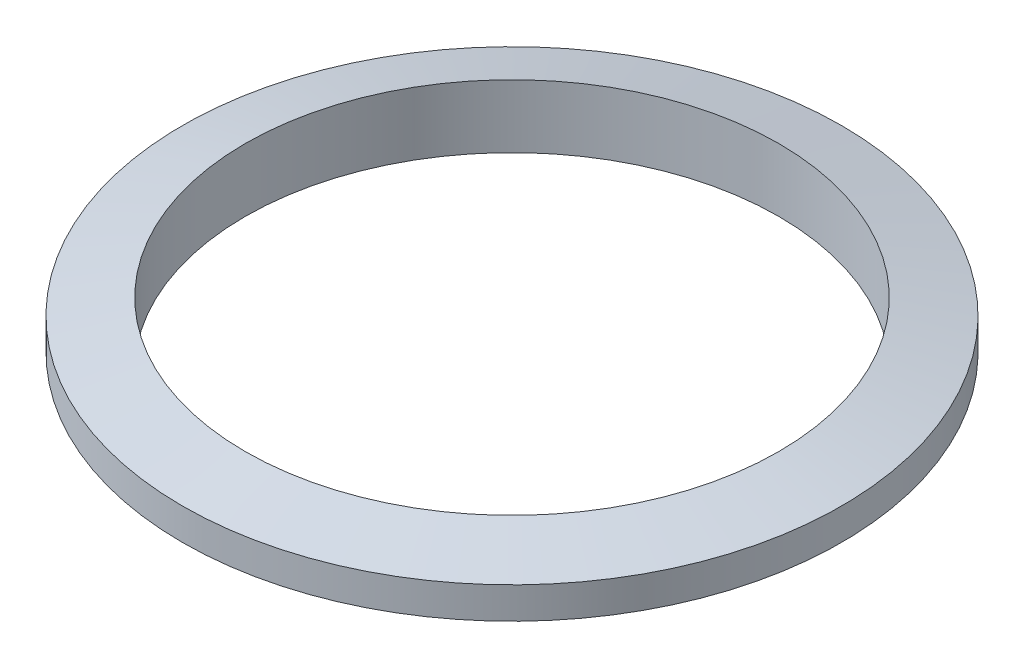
ISO-10303-21;
HEADER;
FILE_DESCRIPTION(('STEP AP214'),'2;1');
FILE_NAME('part.step','',(''),(''),'','','');
FILE_SCHEMA(('AUTOMOTIVE_DESIGN { 1 0 10303 214 1 1 1 1 }'));
ENDSEC;
DATA;
#1=APPLICATION_CONTEXT('core data for automotive mechanical design processes');
#2=APPLICATION_PROTOCOL_DEFINITION('international standard','automotive_design',2000,#1);
#3=PRODUCT_CONTEXT('',#1,'mechanical');
#4=PRODUCT('Part','Part','',(#3));
#5=PRODUCT_RELATED_PRODUCT_CATEGORY('part','',(#4));
#6=PRODUCT_DEFINITION_FORMATION('','',#4);
#7=PRODUCT_DEFINITION_CONTEXT('part definition',#1,'design');
#8=PRODUCT_DEFINITION('design','',#6,#7);
#9=PRODUCT_DEFINITION_SHAPE('','',#8);
#10=(LENGTH_UNIT() NAMED_UNIT(*) SI_UNIT(.MILLI.,.METRE.));
#11=(NAMED_UNIT(*) PLANE_ANGLE_UNIT() SI_UNIT($,.RADIAN.));
#12=(NAMED_UNIT(*) SI_UNIT($,.STERADIAN.) SOLID_ANGLE_UNIT());
#13=UNCERTAINTY_MEASURE_WITH_UNIT(LENGTH_MEASURE(1.E-05),#10,'distance_accuracy_value','');
#14=(GEOMETRIC_REPRESENTATION_CONTEXT(3) GLOBAL_UNCERTAINTY_ASSIGNED_CONTEXT((#13)) GLOBAL_UNIT_ASSIGNED_CONTEXT((#10,
#11,#12)) REPRESENTATION_CONTEXT('',''));
#15=CARTESIAN_POINT('',(0.,0.,0.));
#16=DIRECTION('',(0.,0.,1.));
#17=DIRECTION('',(1.,0.,0.));
#18=AXIS2_PLACEMENT_3D('',#15,#16,#17);
#19=CARTESIAN_POINT('',(-3.,-65.,0.));
#20=DIRECTION('',(0.,-1.,0.));
#21=DIRECTION('',(0.,0.,-1.));
#22=AXIS2_PLACEMENT_3D('',#19,#20,#21);
#23=CONICAL_SURFACE('',#22,8.4492529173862,1.32440496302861);
#24=CARTESIAN_POINT('',(-3.,-65.5,0.));
#25=DIRECTION('',(0.,-1.,0.));
#26=DIRECTION('',(0.,0.,-1.));
#27=AXIS2_PLACEMENT_3D('',#24,#25,#26);
#28=CIRCLE('',#27,10.4373124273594);
#29=CARTESIAN_POINT('',(-3.,-65.5,-10.4373124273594));
#30=VERTEX_POINT('',#29);
#31=EDGE_CURVE('E43',#30,#30,#28,.T.);
#32=ORIENTED_EDGE('',*,*,#31,.F.);
#33=EDGE_LOOP('',(#32));
#34=FACE_BOUND('',#33,.T.);
#35=CARTESIAN_POINT('',(-3.,-65.,0.));
#36=DIRECTION('',(0.,-1.,0.));
#37=DIRECTION('',(0.,0.,-1.));
#38=AXIS2_PLACEMENT_3D('',#35,#36,#37);
#39=CIRCLE('',#38,8.4492529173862);
#40=CARTESIAN_POINT('',(-3.,-65.,-8.4492529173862));
#41=VERTEX_POINT('',#40);
#42=EDGE_CURVE('E10',#41,#41,#39,.T.);
#43=ORIENTED_EDGE('',*,*,#42,.T.);
#44=EDGE_LOOP('',(#43));
#45=FACE_BOUND('',#44,.T.);
#46=ADVANCED_FACE('F29',(#34,#45),#23,.T.);
#47=CARTESIAN_POINT('',(-3.,-69.,0.));
#48=DIRECTION('',(0.,-1.,0.));
#49=DIRECTION('',(0.,0.,-1.));
#50=AXIS2_PLACEMENT_3D('',#47,#48,#49);
#51=CYLINDRICAL_SURFACE('',#50,8.4492529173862);
#52=ORIENTED_EDGE('',*,*,#42,.F.);
#53=EDGE_LOOP('',(#52));
#54=FACE_BOUND('',#53,.T.);
#55=CARTESIAN_POINT('',(-3.,-67.,0.));
#56=DIRECTION('',(0.,-1.,0.));
#57=DIRECTION('',(0.,0.,-1.));
#58=AXIS2_PLACEMENT_3D('',#55,#56,#57);
#59=CIRCLE('',#58,8.4492529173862);
#60=CARTESIAN_POINT('',(-3.,-67.,-8.4492529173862));
#61=VERTEX_POINT('',#60);
#62=EDGE_CURVE('E35',#61,#61,#59,.T.);
#63=ORIENTED_EDGE('',*,*,#62,.T.);
#64=EDGE_LOOP('',(#63));
#65=FACE_BOUND('',#64,.T.);
#66=ADVANCED_FACE('F52',(#54,#65),#51,.F.);
#67=CARTESIAN_POINT('',(-3.,-66.5,0.));
#68=DIRECTION('',(0.,1.,0.));
#69=DIRECTION('',(0.,0.,1.));
#70=AXIS2_PLACEMENT_3D('',#67,#68,#69);
#71=CONICAL_SURFACE('',#70,10.4373124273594,1.32440496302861);
#72=ORIENTED_EDGE('',*,*,#62,.F.);
#73=EDGE_LOOP('',(#72));
#74=FACE_BOUND('',#73,.T.);
#75=CARTESIAN_POINT('',(-3.,-66.5,0.));
#76=DIRECTION('',(0.,-1.,0.));
#77=DIRECTION('',(0.,0.,-1.));
#78=AXIS2_PLACEMENT_3D('',#75,#76,#77);
#79=CIRCLE('',#78,10.4373124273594);
#80=CARTESIAN_POINT('',(-3.,-66.5,-10.4373124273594));
#81=VERTEX_POINT('',#80);
#82=EDGE_CURVE('E39',#81,#81,#79,.T.);
#83=ORIENTED_EDGE('',*,*,#82,.T.);
#84=EDGE_LOOP('',(#83));
#85=FACE_BOUND('',#84,.T.);
#86=ADVANCED_FACE('F56',(#74,#85),#71,.T.);
#87=CARTESIAN_POINT('',(-3.,-69.,0.));
#88=DIRECTION('',(0.,-1.,0.));
#89=DIRECTION('',(0.,0.,-1.));
#90=AXIS2_PLACEMENT_3D('',#87,#88,#89);
#91=CYLINDRICAL_SURFACE('',#90,10.4373124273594);
#92=ORIENTED_EDGE('',*,*,#82,.F.);
#93=EDGE_LOOP('',(#92));
#94=FACE_BOUND('',#93,.T.);
#95=ORIENTED_EDGE('',*,*,#31,.T.);
#96=EDGE_LOOP('',(#95));
#97=FACE_BOUND('',#96,.T.);
#98=ADVANCED_FACE('F49',(#94,#97),#91,.T.);
#99=CLOSED_SHELL('',(#46,#66,#86,#98));
#100=MANIFOLD_SOLID_BREP('B2',#99);
#101=ADVANCED_BREP_SHAPE_REPRESENTATION('',(#18,#100),#14);
#102=SHAPE_DEFINITION_REPRESENTATION(#9,#101);
ENDSEC;
END-ISO-10303-21;
